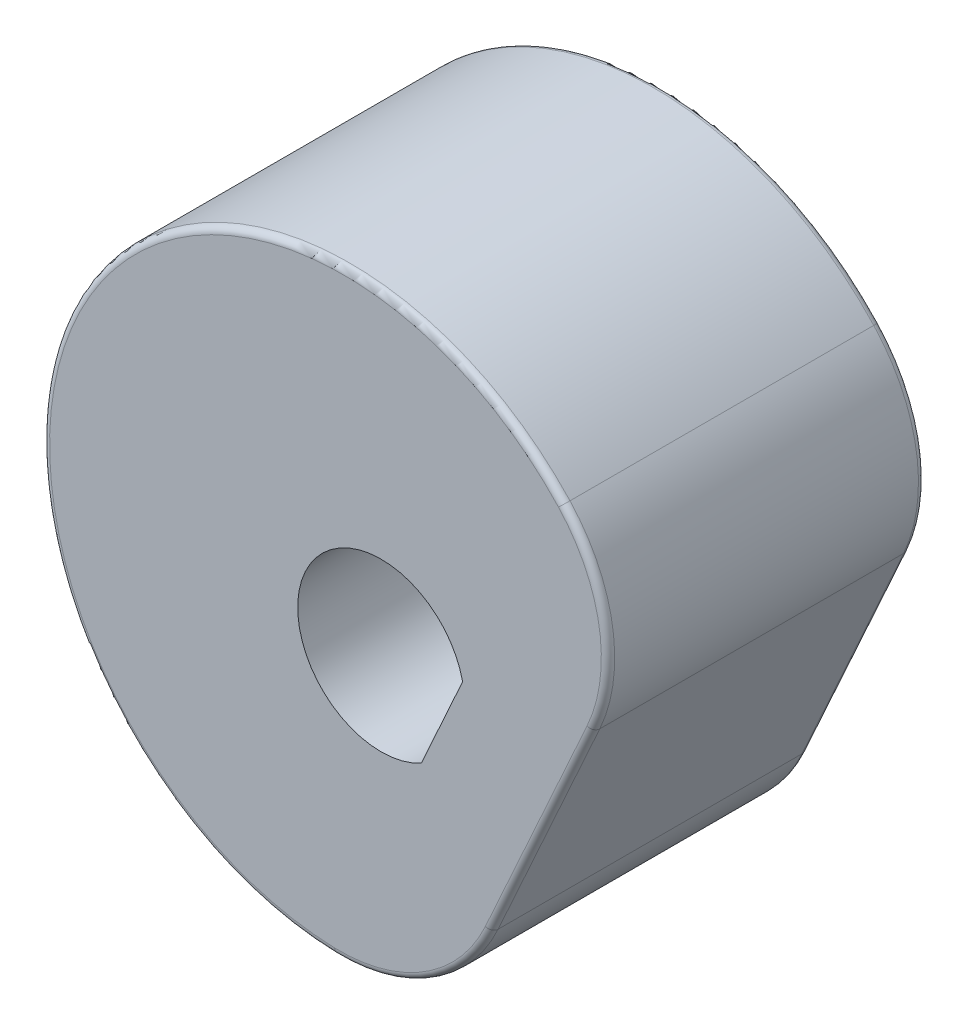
from build123d import *

# Parameters (mm, degrees)
BOSS_EXTRUDE1_DEPTH = 9.5
FILLET1_R           = 0.2


with BuildPart() as part:
    # Sketch1 → Boss-Extrude1 (new body)
    with BuildSketch(Plane.XY.offset(57.7)):
        with BuildLine():
            Line((-7.091103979, 99.06837442), (-4.044891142, 105.790910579))
            ThreePointArc((-4.044891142, 105.790910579), (-3.664510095, 108.660461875), (-4.938022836, 111.25991945))
            ThreePointArc((-4.938022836, 111.25991945), (-19.725685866, 108.844979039), (-11.792001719, 96.134213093))
            ThreePointArc((-11.792001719, 96.134213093), (-8.997890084, 96.890489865), (-7.091103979, 99.06837442))
        make_face()
        with BuildLine():
            Line((-7.954696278, 105.157951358), (-9.192908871, 102.425401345))
            ThreePointArc((-9.192908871, 102.425401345), (-12.672627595, 105.648995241), (-7.954696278, 105.157951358))
        make_face(mode=Mode.SUBTRACT)
    extrude(amount=-BOSS_EXTRUDE1_DEPTH)

    # Fillet1
    fillet1_edges = [part.edges().sort_by_distance(p)[0] for p in [
        (-8.997890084, 96.890489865, 48.2),
        (-5.56799756, 102.429642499, 48.2),
        (-3.664510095, 108.660461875, 48.2),
        (-5.56799756, 102.429642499, 57.7),
        (-8.997890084, 96.890489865, 57.7),
        (-19.725685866, 108.844979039, 57.7),
        (-3.664510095, 108.660461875, 57.7),
        (-19.725685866, 108.844979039, 48.2),
    ]]
    fillet(fillet1_edges, radius=FILLET1_R)


solid = part.part
